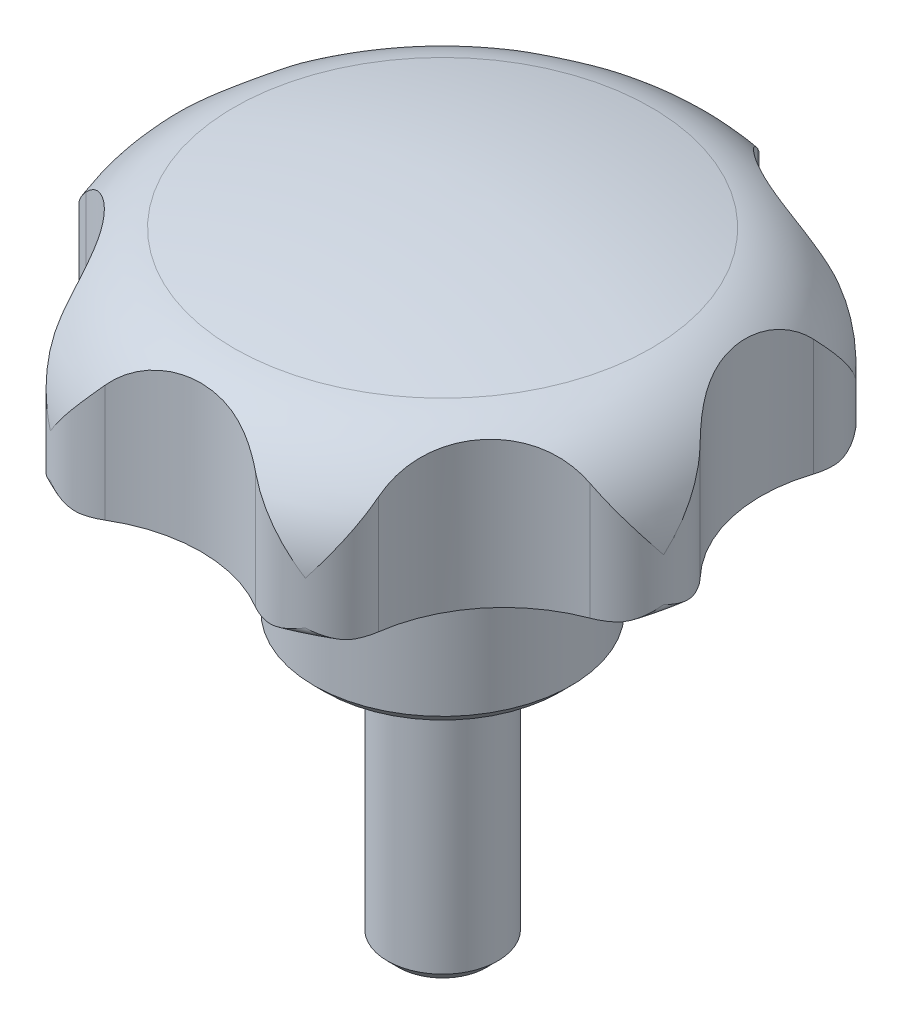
from build123d import *

# Parameters (mm, degrees)
ESQUISSE2_R             = 21
ENL_V_MAT_EXTRU_1_DEPTH = 21
ESQUISSE3_R             = 8
ENL_V_MAT_EXTRU_2_DEPTH = 17


with BuildPart() as part:
    # Esquisse1 → R_volution1 (revolve)
    with BuildSketch(Plane.XY, mode=Mode.PRIVATE) as r_volution1_sk:
        with BuildLine():
            Line((16, 12.848570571), (16, 10.5))
            ThreePointArc((16, 10.5), (15.853553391, 10.146446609), (15.5, 10))
            Line((15.5, 10), (11.7, 10))
            ThreePointArc((11.7, 10), (11.346446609, 10.146446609), (11.2, 10.5))
            Line((11.2, 10.5), (11.2, 16.279152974))
            ThreePointArc((11.2, 16.279152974), (11.091353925, 16.590347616), (10.812631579, 16.766301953))
            ThreePointArc((10.812631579, 16.766301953), (9.703765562, 17.008902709), (8.589473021, 17.225215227))
            ThreePointArc((8.589473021, 17.225215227), (8.179638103, 17.117171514), (8, 16.733285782))
            Line((8, 16.733285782), (8, 11))
            Line((8, 11), (7, 10))
            Line((7, 10), (7, 0.6))
            Line((7, 0.6), (6.4, 0))
            Line((6.4, 0), (0, 0))
            Line((0, 0), (0, 20))
            ThreePointArc((0, 20), (5.719358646, 19.671812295), (11.363636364, 18.691557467))
            ThreePointArc((11.363636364, 18.691557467), (14.700096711, 16.578059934), (16, 12.848570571))
        make_face()
    revolve(r_volution1_sk.sketch.rotate(Axis((0, 0, 0), (0, 1, 0)), 270), axis=Axis((0, 0, 0), (0, 1, 0)))

    # Esquisse2 → Enl_v. mat.-Extru.1 (cut)
    with BuildSketch(Plane(origin=(0, 0, 0), x_dir=(-1, 0, 0), z_dir=(0, 1, 0))):
        Circle(ESQUISSE2_R)
        with BuildLine():
            ThreePointArc((14.842755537, 0.819906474), (15.566010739, 2.094876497), (15.598846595, 3.560334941))
            ThreePointArc((15.598846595, 3.560334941), (14.933423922, 4.866420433), (13.728604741, 5.70132006))
            ThreePointArc((13.728604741, 5.70132006), (10.286064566, 8.202862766), (8.613278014, 12.115736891))
            ThreePointArc((8.613278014, 12.115736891), (8.067408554, 13.476131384), (6.942139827, 14.415501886))
            ThreePointArc((6.942139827, 14.415501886), (5.50611682, 14.709584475), (4.102173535, 14.288170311))
            ThreePointArc((4.102173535, 14.288170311), (1e-09, 13.156370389), (-4.102173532, 14.288170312))
            ThreePointArc((-4.102173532, 14.288170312), (-5.506116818, 14.709584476), (-6.942139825, 14.415501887))
            ThreePointArc((-6.942139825, 14.415501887), (-8.067408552, 13.476131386), (-8.613278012, 12.115736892))
            ThreePointArc((-8.613278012, 12.115736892), (-10.286064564, 8.202862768), (-13.72860474, 5.701320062))
            ThreePointArc((-13.72860474, 5.701320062), (-14.933423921, 4.866420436), (-15.598846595, 3.560334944))
            ThreePointArc((-15.598846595, 3.560334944), (-15.566010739, 2.0948765), (-14.842755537, 0.819906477))
            ThreePointArc((-14.842755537, 0.819906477), (-12.826512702, -2.927567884), (-13.017116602, -7.178740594))
            ThreePointArc((-13.017116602, -7.178740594), (-13.115558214, -8.641257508), (-12.50930372, -9.975836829))
            ThreePointArc((-12.50930372, -9.975836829), (-11.34308935, -10.863863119), (-9.895335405, -11.093330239))
            ThreePointArc((-9.895335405, -11.093330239), (-5.708335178, -11.853480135), (-2.503474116, -14.653063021))
            ThreePointArc((-2.503474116, -14.653063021), (-1.42140554, -15.641894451), (9.395e-06, -16))
            ThreePointArc((9.395e-06, -16), (1.421413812, -15.64189), (2.503474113, -14.653063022))
            ThreePointArc((2.503474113, -14.653063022), (5.708335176, -11.853480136), (9.895335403, -11.09333024))
            ThreePointArc((9.895335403, -11.09333024), (11.343089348, -10.863863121), (12.509303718, -9.975836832))
            ThreePointArc((12.509303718, -9.975836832), (13.115558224, -8.641257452), (13.017116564, -7.178740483))
            ThreePointArc((13.017116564, -7.178740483), (12.826512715, -2.927567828), (14.842755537, 0.819906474))
        make_face(mode=Mode.SUBTRACT)
    extrude(amount=ENL_V_MAT_EXTRU_1_DEPTH, mode=Mode.SUBTRACT)

    # Esquisse3 → Enl_v. mat.-Extru.2 (cut)
    with BuildSketch(Plane(origin=(0, 0, 0), x_dir=(-1, 0, 0), z_dir=(0, 1, 0))):
        with BuildLine():
            ThreePointArc((13.069701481, 0.577260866), (13.648990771, 1.78016747), (13.648990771, 3.115293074))
            ThreePointArc((13.648990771, 3.115293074), (13.069701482, 4.318199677), (12.025858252, 5.150636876))
            ThreePointArc((12.025858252, 5.150636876), (9.242276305, 7.370469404), (7.697504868, 10.578220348))
            ThreePointArc((7.697504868, 10.578220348), (7.118215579, 11.781126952), (6.074372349, 12.61356415))
            ThreePointArc((6.074372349, 12.61356415), (4.772721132, 12.910657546), (3.471069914, 12.61356415))
            ThreePointArc((3.471069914, 12.61356415), (1e-09, 11.821315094), (-3.471069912, 12.613564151))
            ThreePointArc((-3.471069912, 12.613564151), (-4.772721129, 12.910657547), (-6.074372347, 12.613564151))
            ThreePointArc((-6.074372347, 12.613564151), (-7.118215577, 11.781126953), (-7.697504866, 10.578220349))
            ThreePointArc((-7.697504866, 10.578220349), (-9.242276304, 7.370469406), (-12.025858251, 5.150636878))
            ThreePointArc((-12.025858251, 5.150636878), (-13.069701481, 4.31819968), (-13.64899077, 3.115293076))
            ThreePointArc((-13.64899077, 3.115293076), (-13.64899077, 1.780167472), (-13.069701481, 0.577260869))
            ThreePointArc((-13.069701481, 0.577260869), (-11.524930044, -2.630490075), (-11.524930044, -6.190825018))
            ThreePointArc((-11.524930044, -6.190825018), (-11.524930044, -7.525950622), (-10.945640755, -8.728857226))
            ThreePointArc((-10.945640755, -8.728857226), (-9.901797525, -9.561294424), (-8.600146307, -9.85838782))
            ThreePointArc((-8.600146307, -9.85838782), (-5.129076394, -10.650636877), (-2.345494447, -12.870469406))
            ThreePointArc((-2.345494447, -12.870469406), (-1.301648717, -13.702907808), (5.552e-06, -14))
            ThreePointArc((5.552e-06, -14), (1.301653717, -13.7029054), (2.345494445, -12.870469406))
            ThreePointArc((2.345494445, -12.870469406), (5.129076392, -10.650636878), (8.600146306, -9.858387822))
            ThreePointArc((8.600146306, -9.858387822), (9.901797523, -9.561294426), (10.945640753, -8.728857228))
            ThreePointArc((10.945640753, -8.728857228), (11.524930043, -7.525950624), (11.524930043, -6.19082502))
            ThreePointArc((11.524930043, -6.19082502), (11.524930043, -2.630490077), (13.069701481, 0.577260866))
        make_face()
        with Locations(Location((0, 0, 0), (0, 0, 90))):
            Circle(ESQUISSE3_R, mode=Mode.SUBTRACT)
    extrude(amount=ENL_V_MAT_EXTRU_2_DEPTH, mode=Mode.SUBTRACT)

    # Esquisse4 → R_volution2 (revolve)
    with BuildSketch(Plane.XY):
        Polygon((0, 0), (3, 0), (3, -14.3865), (2.3865, -15), (0, -15), align=None)
    revolve(axis=Axis((0, -15, 0), (0, 1, 0)))


solid = part.part
